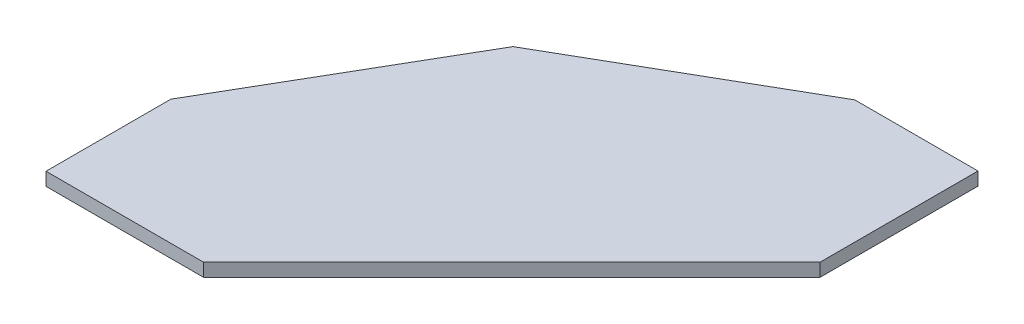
ISO-10303-21;
HEADER;
FILE_DESCRIPTION(('STEP AP214'),'2;1');
FILE_NAME('part.step','',(''),(''),'','','');
FILE_SCHEMA(('AUTOMOTIVE_DESIGN { 1 0 10303 214 1 1 1 1 }'));
ENDSEC;
DATA;
#1=APPLICATION_CONTEXT('core data for automotive mechanical design processes');
#2=APPLICATION_PROTOCOL_DEFINITION('international standard','automotive_design',2000,#1);
#3=PRODUCT_CONTEXT('',#1,'mechanical');
#4=PRODUCT('Part','Part','',(#3));
#5=PRODUCT_RELATED_PRODUCT_CATEGORY('part','',(#4));
#6=PRODUCT_DEFINITION_FORMATION('','',#4);
#7=PRODUCT_DEFINITION_CONTEXT('part definition',#1,'design');
#8=PRODUCT_DEFINITION('design','',#6,#7);
#9=PRODUCT_DEFINITION_SHAPE('','',#8);
#10=(LENGTH_UNIT() NAMED_UNIT(*) SI_UNIT(.MILLI.,.METRE.));
#11=(NAMED_UNIT(*) PLANE_ANGLE_UNIT() SI_UNIT($,.RADIAN.));
#12=(NAMED_UNIT(*) SI_UNIT($,.STERADIAN.) SOLID_ANGLE_UNIT());
#13=UNCERTAINTY_MEASURE_WITH_UNIT(LENGTH_MEASURE(1.E-05),#10,'distance_accuracy_value','');
#14=(GEOMETRIC_REPRESENTATION_CONTEXT(3) GLOBAL_UNCERTAINTY_ASSIGNED_CONTEXT((#13)) GLOBAL_UNIT_ASSIGNED_CONTEXT((#10,
#11,#12)) REPRESENTATION_CONTEXT('',''));
#15=CARTESIAN_POINT('',(0.,0.,0.));
#16=DIRECTION('',(0.,0.,1.));
#17=DIRECTION('',(1.,0.,0.));
#18=AXIS2_PLACEMENT_3D('',#15,#16,#17);
#19=CARTESIAN_POINT('',(-270.,23.,-270.));
#20=DIRECTION('',(-0.707106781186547,0.,-0.707106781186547));
#21=DIRECTION('',(-0.707106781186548,0.,0.707106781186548));
#22=AXIS2_PLACEMENT_3D('',#19,#20,#21);
#23=PLANE('',#22);
#24=DIRECTION('',(0.707106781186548,0.,-0.707106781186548));
#25=VECTOR('',#24,1.);
#26=CARTESIAN_POINT('',(-270.,0.,-270.));
#27=LINE('',#26,#25);
#28=CARTESIAN_POINT('',(-540.,0.,0.));
#29=VERTEX_POINT('',#28);
#30=CARTESIAN_POINT('',(0.,0.,-540.));
#31=VERTEX_POINT('',#30);
#32=EDGE_CURVE('E125',#29,#31,#27,.T.);
#33=ORIENTED_EDGE('',*,*,#32,.T.);
#34=DIRECTION('',(0.,-1.,0.));
#35=VECTOR('',#34,1.);
#36=CARTESIAN_POINT('',(0.,23.,-540.));
#37=LINE('',#36,#35);
#38=CARTESIAN_POINT('',(0.,23.,-540.));
#39=VERTEX_POINT('',#38);
#40=EDGE_CURVE('E11',#39,#31,#37,.T.);
#41=ORIENTED_EDGE('',*,*,#40,.F.);
#42=DIRECTION('',(0.707106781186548,0.,-0.707106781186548));
#43=VECTOR('',#42,1.);
#44=CARTESIAN_POINT('',(-270.,23.,-270.));
#45=LINE('',#44,#43);
#46=CARTESIAN_POINT('',(-540.,23.,0.));
#47=VERTEX_POINT('',#46);
#48=EDGE_CURVE('E86',#47,#39,#45,.T.);
#49=ORIENTED_EDGE('',*,*,#48,.F.);
#50=DIRECTION('',(0.,-1.,0.));
#51=VECTOR('',#50,1.);
#52=CARTESIAN_POINT('',(-540.,23.,0.));
#53=LINE('',#52,#51);
#54=EDGE_CURVE('E124',#47,#29,#53,.T.);
#55=ORIENTED_EDGE('',*,*,#54,.T.);
#56=EDGE_LOOP('',(#33,#41,#49,#55));
#57=FACE_BOUND('',#56,.T.);
#58=ADVANCED_FACE('F34',(#57),#23,.F.);
#59=CARTESIAN_POINT('',(0.,23.,0.));
#60=DIRECTION('',(1.,0.,0.));
#61=DIRECTION('',(0.,0.,-1.));
#62=AXIS2_PLACEMENT_3D('',#59,#60,#61);
#63=PLANE('',#62);
#64=DIRECTION('',(0.,0.,1.));
#65=VECTOR('',#64,1.);
#66=CARTESIAN_POINT('',(0.,0.,0.));
#67=LINE('',#66,#65);
#68=CARTESIAN_POINT('',(0.,0.,-816.959975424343));
#69=VERTEX_POINT('',#68);
#70=EDGE_CURVE('E128',#69,#31,#67,.T.);
#71=ORIENTED_EDGE('',*,*,#70,.F.);
#72=DIRECTION('',(0.,-1.,0.));
#73=VECTOR('',#72,1.);
#74=CARTESIAN_POINT('',(0.,23.,-816.959975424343));
#75=LINE('',#74,#73);
#76=CARTESIAN_POINT('',(0.,23.,-816.959975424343));
#77=VERTEX_POINT('',#76);
#78=EDGE_CURVE('E42',#77,#69,#75,.T.);
#79=ORIENTED_EDGE('',*,*,#78,.F.);
#80=DIRECTION('',(0.,0.,1.));
#81=VECTOR('',#80,1.);
#82=CARTESIAN_POINT('',(0.,23.,0.));
#83=LINE('',#82,#81);
#84=EDGE_CURVE('E158',#77,#39,#83,.T.);
#85=ORIENTED_EDGE('',*,*,#84,.T.);
#86=ORIENTED_EDGE('',*,*,#40,.T.);
#87=EDGE_LOOP('',(#71,#79,#85,#86));
#88=FACE_BOUND('',#87,.T.);
#89=ADVANCED_FACE('F151',(#88),#63,.T.);
#90=CARTESIAN_POINT('',(0.,23.,-816.959975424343));
#91=DIRECTION('',(0.,0.,-1.));
#92=DIRECTION('',(-1.,0.,0.));
#93=AXIS2_PLACEMENT_3D('',#90,#91,#92);
#94=PLANE('',#93);
#95=DIRECTION('',(1.,0.,0.));
#96=VECTOR('',#95,1.);
#97=CARTESIAN_POINT('',(0.,0.,-816.959975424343));
#98=LINE('',#97,#96);
#99=CARTESIAN_POINT('',(-215.873570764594,0.,-816.959975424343));
#100=VERTEX_POINT('',#99);
#101=EDGE_CURVE('E131',#100,#69,#98,.T.);
#102=ORIENTED_EDGE('',*,*,#101,.F.);
#103=DIRECTION('',(0.,-1.,0.));
#104=VECTOR('',#103,1.);
#105=CARTESIAN_POINT('',(-215.873570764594,23.,-816.959975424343));
#106=LINE('',#105,#104);
#107=CARTESIAN_POINT('',(-215.873570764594,23.,-816.959975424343));
#108=VERTEX_POINT('',#107);
#109=EDGE_CURVE('E143',#108,#100,#106,.T.);
#110=ORIENTED_EDGE('',*,*,#109,.F.);
#111=DIRECTION('',(1.,0.,0.));
#112=VECTOR('',#111,1.);
#113=CARTESIAN_POINT('',(0.,23.,-816.959975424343));
#114=LINE('',#113,#112);
#115=EDGE_CURVE('E119',#108,#77,#114,.T.);
#116=ORIENTED_EDGE('',*,*,#115,.T.);
#117=ORIENTED_EDGE('',*,*,#78,.T.);
#118=EDGE_LOOP('',(#102,#110,#116,#117));
#119=FACE_BOUND('',#118,.T.);
#120=ADVANCED_FACE('F148',(#119),#94,.T.);
#121=CARTESIAN_POINT('',(-406.689400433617,23.,-707.232602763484));
#122=DIRECTION('',(-0.498499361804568,0.,-0.866890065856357));
#123=DIRECTION('',(-0.866890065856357,0.,0.498499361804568));
#124=AXIS2_PLACEMENT_3D('',#121,#122,#123);
#125=PLANE('',#124);
#126=DIRECTION('',(0.866890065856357,0.,-0.498499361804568));
#127=VECTOR('',#126,1.);
#128=CARTESIAN_POINT('',(-406.689400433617,0.,-707.232602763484));
#129=LINE('',#128,#127);
#130=CARTESIAN_POINT('',(-596.191805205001,0.,-598.260506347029));
#131=VERTEX_POINT('',#130);
#132=EDGE_CURVE('E134',#131,#100,#129,.T.);
#133=ORIENTED_EDGE('',*,*,#132,.F.);
#134=DIRECTION('',(0.,-1.,0.));
#135=VECTOR('',#134,1.);
#136=CARTESIAN_POINT('',(-596.191805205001,23.,-598.260506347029));
#137=LINE('',#136,#135);
#138=CARTESIAN_POINT('',(-596.191805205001,23.,-598.260506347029));
#139=VERTEX_POINT('',#138);
#140=EDGE_CURVE('E107',#139,#131,#137,.T.);
#141=ORIENTED_EDGE('',*,*,#140,.F.);
#142=DIRECTION('',(0.866890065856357,0.,-0.498499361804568));
#143=VECTOR('',#142,1.);
#144=CARTESIAN_POINT('',(-406.689400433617,23.,-707.232602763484));
#145=LINE('',#144,#143);
#146=EDGE_CURVE('E117',#139,#108,#145,.T.);
#147=ORIENTED_EDGE('',*,*,#146,.T.);
#148=ORIENTED_EDGE('',*,*,#109,.T.);
#149=EDGE_LOOP('',(#133,#141,#147,#148));
#150=FACE_BOUND('',#149,.T.);
#151=ADVANCED_FACE('F157',(#150),#125,.T.);
#152=CARTESIAN_POINT('',(-705.819653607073,23.,-409.136700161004));
#153=DIRECTION('',(-0.865158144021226,0.,-0.501499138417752));
#154=DIRECTION('',(-0.501499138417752,0.,0.865158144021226));
#155=AXIS2_PLACEMENT_3D('',#152,#153,#154);
#156=PLANE('',#155);
#157=DIRECTION('',(0.501499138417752,0.,-0.865158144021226));
#158=VECTOR('',#157,1.);
#159=CARTESIAN_POINT('',(-705.819653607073,0.,-409.136700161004));
#160=LINE('',#159,#158);
#161=CARTESIAN_POINT('',(-816.207323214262,0.,-218.70209311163));
#162=VERTEX_POINT('',#161);
#163=EDGE_CURVE('E106',#162,#131,#160,.T.);
#164=ORIENTED_EDGE('',*,*,#163,.F.);
#165=DIRECTION('',(0.,-1.,0.));
#166=VECTOR('',#165,1.);
#167=CARTESIAN_POINT('',(-816.207323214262,23.,-218.70209311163));
#168=LINE('',#167,#166);
#169=CARTESIAN_POINT('',(-816.207323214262,23.,-218.70209311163));
#170=VERTEX_POINT('',#169);
#171=EDGE_CURVE('E100',#170,#162,#168,.T.);
#172=ORIENTED_EDGE('',*,*,#171,.F.);
#173=DIRECTION('',(0.501499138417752,0.,-0.865158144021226));
#174=VECTOR('',#173,1.);
#175=CARTESIAN_POINT('',(-705.819653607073,23.,-409.136700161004));
#176=LINE('',#175,#174);
#177=EDGE_CURVE('E104',#170,#139,#176,.T.);
#178=ORIENTED_EDGE('',*,*,#177,.T.);
#179=ORIENTED_EDGE('',*,*,#140,.T.);
#180=EDGE_LOOP('',(#164,#172,#178,#179));
#181=FACE_BOUND('',#180,.T.);
#182=ADVANCED_FACE('F102',(#181),#156,.T.);
#183=CARTESIAN_POINT('',(-816.207323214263,23.,0.));
#184=DIRECTION('',(1.,0.,0.));
#185=DIRECTION('',(0.,0.,-1.));
#186=AXIS2_PLACEMENT_3D('',#183,#184,#185);
#187=PLANE('',#186);
#188=DIRECTION('',(0.,0.,1.));
#189=VECTOR('',#188,1.);
#190=CARTESIAN_POINT('',(-816.207323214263,0.,0.));
#191=LINE('',#190,#189);
#192=CARTESIAN_POINT('',(-816.207323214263,0.,0.));
#193=VERTEX_POINT('',#192);
#194=EDGE_CURVE('E74',#162,#193,#191,.T.);
#195=ORIENTED_EDGE('',*,*,#194,.T.);
#196=DIRECTION('',(0.,-1.,0.));
#197=VECTOR('',#196,1.);
#198=CARTESIAN_POINT('',(-816.207323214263,23.,0.));
#199=LINE('',#198,#197);
#200=CARTESIAN_POINT('',(-816.207323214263,23.,0.));
#201=VERTEX_POINT('',#200);
#202=EDGE_CURVE('E108',#201,#193,#199,.T.);
#203=ORIENTED_EDGE('',*,*,#202,.F.);
#204=DIRECTION('',(0.,0.,1.));
#205=VECTOR('',#204,1.);
#206=CARTESIAN_POINT('',(-816.207323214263,23.,0.));
#207=LINE('',#206,#205);
#208=EDGE_CURVE('E110',#170,#201,#207,.T.);
#209=ORIENTED_EDGE('',*,*,#208,.F.);
#210=ORIENTED_EDGE('',*,*,#171,.T.);
#211=EDGE_LOOP('',(#195,#203,#209,#210));
#212=FACE_BOUND('',#211,.T.);
#213=ADVANCED_FACE('F111',(#212),#187,.F.);
#214=CARTESIAN_POINT('',(0.,23.,0.));
#215=DIRECTION('',(0.,0.,-1.));
#216=DIRECTION('',(-1.,0.,0.));
#217=AXIS2_PLACEMENT_3D('',#214,#215,#216);
#218=PLANE('',#217);
#219=DIRECTION('',(1.,0.,0.));
#220=VECTOR('',#219,1.);
#221=CARTESIAN_POINT('',(0.,0.,0.));
#222=LINE('',#221,#220);
#223=EDGE_CURVE('E80',#193,#29,#222,.T.);
#224=ORIENTED_EDGE('',*,*,#223,.T.);
#225=ORIENTED_EDGE('',*,*,#54,.F.);
#226=DIRECTION('',(1.,0.,0.));
#227=VECTOR('',#226,1.);
#228=CARTESIAN_POINT('',(0.,23.,0.));
#229=LINE('',#228,#227);
#230=EDGE_CURVE('E50',#201,#47,#229,.T.);
#231=ORIENTED_EDGE('',*,*,#230,.F.);
#232=ORIENTED_EDGE('',*,*,#202,.T.);
#233=EDGE_LOOP('',(#224,#225,#231,#232));
#234=FACE_BOUND('',#233,.T.);
#235=ADVANCED_FACE('F174',(#234),#218,.F.);
#236=CARTESIAN_POINT('',(0.,23.,0.));
#237=DIRECTION('',(0.,1.,0.));
#238=DIRECTION('',(0.,0.,1.));
#239=AXIS2_PLACEMENT_3D('',#236,#237,#238);
#240=PLANE('',#239);
#241=ORIENTED_EDGE('',*,*,#48,.T.);
#242=ORIENTED_EDGE('',*,*,#84,.F.);
#243=ORIENTED_EDGE('',*,*,#115,.F.);
#244=ORIENTED_EDGE('',*,*,#146,.F.);
#245=ORIENTED_EDGE('',*,*,#177,.F.);
#246=ORIENTED_EDGE('',*,*,#208,.T.);
#247=ORIENTED_EDGE('',*,*,#230,.T.);
#248=EDGE_LOOP('',(#241,#242,#243,#244,#245,#246,#247));
#249=FACE_BOUND('',#248,.T.);
#250=ADVANCED_FACE('F114',(#249),#240,.T.);
#251=CARTESIAN_POINT('',(0.,0.,0.));
#252=DIRECTION('',(0.,1.,0.));
#253=DIRECTION('',(0.,0.,1.));
#254=AXIS2_PLACEMENT_3D('',#251,#252,#253);
#255=PLANE('',#254);
#256=ORIENTED_EDGE('',*,*,#32,.F.);
#257=ORIENTED_EDGE('',*,*,#223,.F.);
#258=ORIENTED_EDGE('',*,*,#194,.F.);
#259=ORIENTED_EDGE('',*,*,#163,.T.);
#260=ORIENTED_EDGE('',*,*,#132,.T.);
#261=ORIENTED_EDGE('',*,*,#101,.T.);
#262=ORIENTED_EDGE('',*,*,#70,.T.);
#263=EDGE_LOOP('',(#256,#257,#258,#259,#260,#261,#262));
#264=FACE_BOUND('',#263,.T.);
#265=ADVANCED_FACE('F154',(#264),#255,.F.);
#266=CLOSED_SHELL('',(#58,#89,#120,#151,#182,#213,#235,#250,#265));
#267=MANIFOLD_SOLID_BREP('B2',#266);
#268=ADVANCED_BREP_SHAPE_REPRESENTATION('',(#18,#267),#14);
#269=SHAPE_DEFINITION_REPRESENTATION(#9,#268);
ENDSEC;
END-ISO-10303-21;
